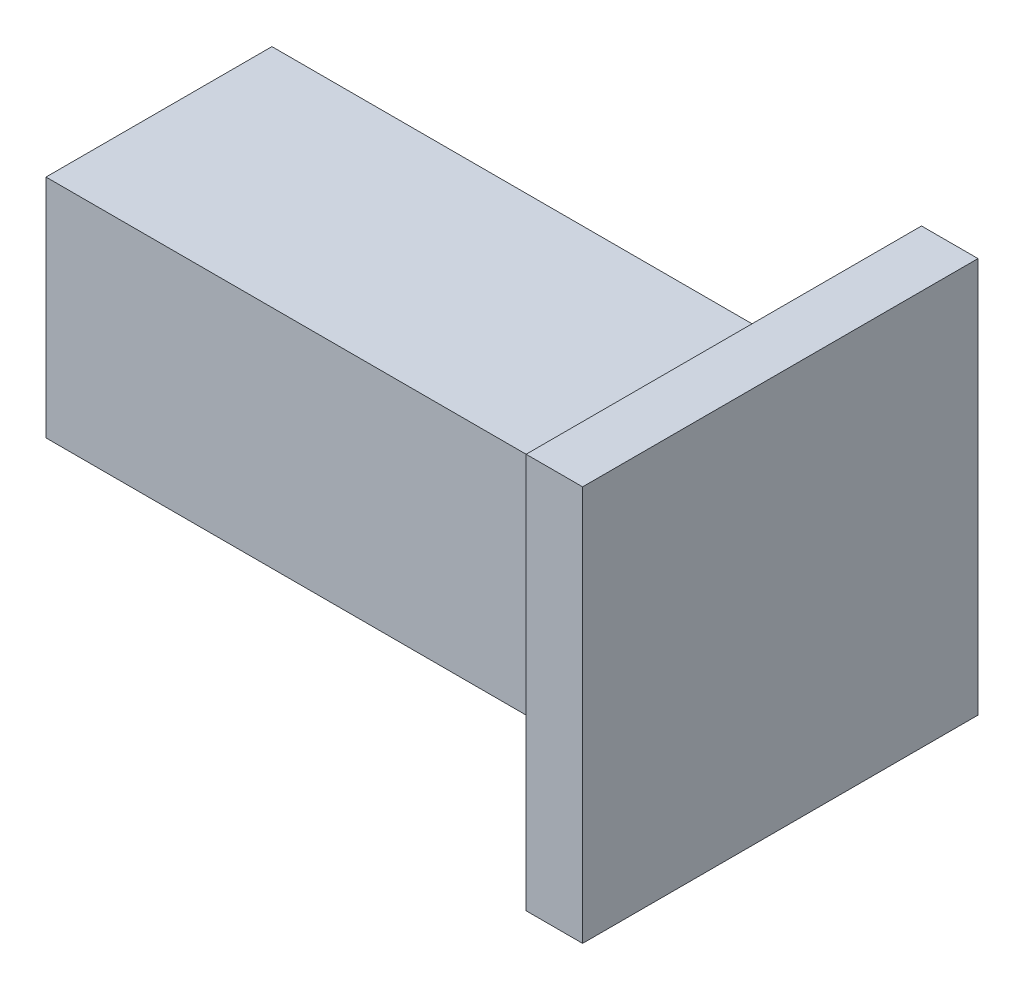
from build123d import *

# Parameters (mm, degrees)
SKIZZE1_W                       = 100
SKIZZE1_H                       = 40
AUFSATZ_LINEAR_AUSTRAGEN1_DEPTH = 40
SKIZZE2_W                       = 70
SKIZZE2_H                       = 70
AUFSATZ_LINEAR_AUSTRAGEN2_DEPTH = 10
VERRUNDUNG1_R                   = 3


with BuildPart() as part:
    # Skizze1 → Aufsatz-Linear austragen1 (new body)
    with BuildSketch(Plane.XY):
        with Locations((50, -35)):
            Rectangle(SKIZZE1_W, SKIZZE1_H)
    extrude(amount=AUFSATZ_LINEAR_AUSTRAGEN1_DEPTH)

    # Skizze2 → Aufsatz-Linear austragen2 (add)
    with BuildSketch(Plane(origin=(100, 0, 0), x_dir=(0, 0, -1), z_dir=(1, 0, 0))):
        with Locations((-20, -35)):
            Rectangle(SKIZZE2_W, SKIZZE2_H)
    extrude(amount=AUFSATZ_LINEAR_AUSTRAGEN2_DEPTH)

    # Verrundung1
    verrundung1_edges = [part.edges().sort_by_distance(p)[0] for p in [
        (100, -35, 40),
        (100, -35, 0),
        (100, -15, 20),
        (100, -55, 20),
    ]]
    fillet(verrundung1_edges, radius=VERRUNDUNG1_R)


solid = part.part
